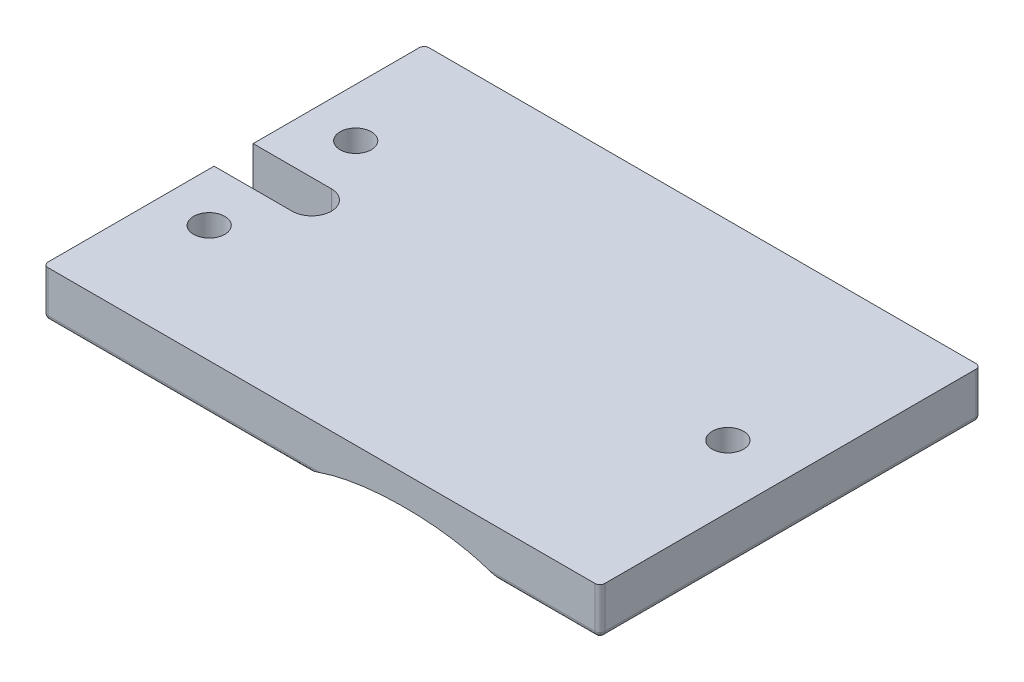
ISO-10303-21;
HEADER;
FILE_DESCRIPTION(('STEP AP214'),'2;1');
FILE_NAME('part.step','',(''),(''),'','','');
FILE_SCHEMA(('AUTOMOTIVE_DESIGN { 1 0 10303 214 1 1 1 1 }'));
ENDSEC;
DATA;
#1=APPLICATION_CONTEXT('core data for automotive mechanical design processes');
#2=APPLICATION_PROTOCOL_DEFINITION('international standard','automotive_design',2000,#1);
#3=PRODUCT_CONTEXT('',#1,'mechanical');
#4=PRODUCT('Part','Part','',(#3));
#5=PRODUCT_RELATED_PRODUCT_CATEGORY('part','',(#4));
#6=PRODUCT_DEFINITION_FORMATION('','',#4);
#7=PRODUCT_DEFINITION_CONTEXT('part definition',#1,'design');
#8=PRODUCT_DEFINITION('design','',#6,#7);
#9=PRODUCT_DEFINITION_SHAPE('','',#8);
#10=(LENGTH_UNIT() NAMED_UNIT(*) SI_UNIT(.MILLI.,.METRE.));
#11=(NAMED_UNIT(*) PLANE_ANGLE_UNIT() SI_UNIT($,.RADIAN.));
#12=(NAMED_UNIT(*) SI_UNIT($,.STERADIAN.) SOLID_ANGLE_UNIT());
#13=UNCERTAINTY_MEASURE_WITH_UNIT(LENGTH_MEASURE(1.E-05),#10,'distance_accuracy_value','');
#14=(GEOMETRIC_REPRESENTATION_CONTEXT(3) GLOBAL_UNCERTAINTY_ASSIGNED_CONTEXT((#13)) GLOBAL_UNIT_ASSIGNED_CONTEXT((#10,
#11,#12)) REPRESENTATION_CONTEXT('',''));
#15=CARTESIAN_POINT('',(0.,0.,0.));
#16=DIRECTION('',(0.,0.,1.));
#17=DIRECTION('',(1.,0.,0.));
#18=AXIS2_PLACEMENT_3D('',#15,#16,#17);
#19=CARTESIAN_POINT('',(-43.7316784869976,4.75,-5.7919621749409));
#20=DIRECTION('',(1.,0.,0.));
#21=DIRECTION('',(0.,0.,-1.));
#22=AXIS2_PLACEMENT_3D('',#19,#20,#21);
#23=PLANE('',#22);
#24=DIRECTION('',(0.,1.,0.));
#25=VECTOR('',#24,1.);
#26=CARTESIAN_POINT('',(-43.7316784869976,0.,15.7080378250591));
#27=LINE('',#26,#25);
#28=CARTESIAN_POINT('',(-43.7316784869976,0.5,15.7080378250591));
#29=VERTEX_POINT('',#28);
#30=CARTESIAN_POINT('',(-43.7316784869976,4.75,15.7080378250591));
#31=VERTEX_POINT('',#30);
#32=EDGE_CURVE('E209',#29,#31,#27,.T.);
#33=ORIENTED_EDGE('',*,*,#32,.F.);
#34=DIRECTION('',(0.,0.,1.));
#35=VECTOR('',#34,1.);
#36=CARTESIAN_POINT('',(-43.7316784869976,0.5,-5.7919621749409));
#37=LINE('',#36,#35);
#38=CARTESIAN_POINT('',(-43.7316784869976,0.5,32.7080378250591));
#39=VERTEX_POINT('',#38);
#40=EDGE_CURVE('E359',#29,#39,#37,.T.);
#41=ORIENTED_EDGE('',*,*,#40,.T.);
#42=DIRECTION('',(0.,-1.,0.));
#43=VECTOR('',#42,1.);
#44=CARTESIAN_POINT('',(-43.7316784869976,4.75,32.7080378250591));
#45=LINE('',#44,#43);
#46=CARTESIAN_POINT('',(-43.7316784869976,4.75,32.7080378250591));
#47=VERTEX_POINT('',#46);
#48=EDGE_CURVE('E358',#39,#47,#45,.F.);
#49=ORIENTED_EDGE('',*,*,#48,.T.);
#50=DIRECTION('',(0.,0.,1.));
#51=VECTOR('',#50,1.);
#52=CARTESIAN_POINT('',(-43.7316784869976,4.75,-5.7919621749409));
#53=LINE('',#52,#51);
#54=EDGE_CURVE('E245',#31,#47,#53,.T.);
#55=ORIENTED_EDGE('',*,*,#54,.F.);
#56=EDGE_LOOP('',(#33,#41,#49,#55));
#57=FACE_BOUND('',#56,.T.);
#58=ADVANCED_FACE('F35',(#57),#23,.F.);
#59=CARTESIAN_POINT('',(0.,4.75,0.));
#60=DIRECTION('',(0.,1.,0.));
#61=DIRECTION('',(0.,0.,1.));
#62=AXIS2_PLACEMENT_3D('',#59,#60,#61);
#63=PLANE('',#62);
#64=CARTESIAN_POINT('',(6.86832151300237,4.75,13.7080378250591));
#65=DIRECTION('',(0.,-1.,0.));
#66=DIRECTION('',(0.,0.,-1.));
#67=AXIS2_PLACEMENT_3D('',#64,#65,#66);
#68=CIRCLE('',#67,1.6);
#69=CARTESIAN_POINT('',(6.86832151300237,4.75,12.1080378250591));
#70=VERTEX_POINT('',#69);
#71=EDGE_CURVE('E219',#70,#70,#68,.T.);
#72=ORIENTED_EDGE('',*,*,#71,.T.);
#73=EDGE_LOOP('',(#72));
#74=FACE_BOUND('',#73,.T.);
#75=CARTESIAN_POINT('',(-38.7316784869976,4.75,21.2080378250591));
#76=DIRECTION('',(0.,-1.,0.));
#77=DIRECTION('',(0.,0.,-1.));
#78=AXIS2_PLACEMENT_3D('',#75,#76,#77);
#79=CIRCLE('',#78,1.6);
#80=CARTESIAN_POINT('',(-38.7316784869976,4.75,19.6080378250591));
#81=VERTEX_POINT('',#80);
#82=EDGE_CURVE('E228',#81,#81,#79,.T.);
#83=ORIENTED_EDGE('',*,*,#82,.T.);
#84=EDGE_LOOP('',(#83));
#85=FACE_BOUND('',#84,.T.);
#86=CARTESIAN_POINT('',(-38.7316784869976,4.75,6.2080378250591));
#87=DIRECTION('',(0.,-1.,0.));
#88=DIRECTION('',(0.,0.,-1.));
#89=AXIS2_PLACEMENT_3D('',#86,#87,#88);
#90=CIRCLE('',#89,1.6);
#91=CARTESIAN_POINT('',(-38.7316784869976,4.75,4.60803782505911));
#92=VERTEX_POINT('',#91);
#93=EDGE_CURVE('E237',#92,#92,#90,.T.);
#94=ORIENTED_EDGE('',*,*,#93,.T.);
#95=EDGE_LOOP('',(#94));
#96=FACE_BOUND('',#95,.T.);
#97=CARTESIAN_POINT('',(-35.7316784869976,4.75,13.7080378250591));
#98=DIRECTION('',(0.,1.,0.));
#99=DIRECTION('',(0.,0.,1.));
#100=AXIS2_PLACEMENT_3D('',#97,#98,#99);
#101=CIRCLE('',#100,2.);
#102=CARTESIAN_POINT('',(-35.7316784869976,4.75,15.7080378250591));
#103=VERTEX_POINT('',#102);
#104=CARTESIAN_POINT('',(-35.7316784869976,4.75,11.7080378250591));
#105=VERTEX_POINT('',#104);
#106=EDGE_CURVE('E203',#103,#105,#101,.T.);
#107=ORIENTED_EDGE('',*,*,#106,.F.);
#108=DIRECTION('',(-1.,0.,0.));
#109=VECTOR('',#108,1.);
#110=CARTESIAN_POINT('',(0.,4.75,15.7080378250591));
#111=LINE('',#110,#109);
#112=EDGE_CURVE('E184',#103,#31,#111,.T.);
#113=ORIENTED_EDGE('',*,*,#112,.T.);
#114=ORIENTED_EDGE('',*,*,#54,.T.);
#115=CARTESIAN_POINT('',(-43.2316784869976,4.75,32.7080378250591));
#116=DIRECTION('',(0.,1.,0.));
#117=DIRECTION('',(0.,0.,1.));
#118=AXIS2_PLACEMENT_3D('',#115,#116,#117);
#119=CIRCLE('',#118,0.5);
#120=CARTESIAN_POINT('',(-43.2316784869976,4.75,33.2080378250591));
#121=VERTEX_POINT('',#120);
#122=EDGE_CURVE('E419',#47,#121,#119,.T.);
#123=ORIENTED_EDGE('',*,*,#122,.T.);
#124=DIRECTION('',(1.,0.,0.));
#125=VECTOR('',#124,1.);
#126=CARTESIAN_POINT('',(-43.7316784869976,4.75,33.2080378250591));
#127=LINE('',#126,#125);
#128=CARTESIAN_POINT('',(12.7683215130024,4.75,33.2080378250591));
#129=VERTEX_POINT('',#128);
#130=EDGE_CURVE('E542',#121,#129,#127,.T.);
#131=ORIENTED_EDGE('',*,*,#130,.T.);
#132=CARTESIAN_POINT('',(12.7683215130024,4.75,32.7080378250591));
#133=DIRECTION('',(0.,1.,0.));
#134=DIRECTION('',(0.,0.,1.));
#135=AXIS2_PLACEMENT_3D('',#132,#133,#134);
#136=CIRCLE('',#135,0.5);
#137=CARTESIAN_POINT('',(13.2683215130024,4.75,32.7080378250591));
#138=VERTEX_POINT('',#137);
#139=EDGE_CURVE('E417',#129,#138,#136,.T.);
#140=ORIENTED_EDGE('',*,*,#139,.T.);
#141=DIRECTION('',(0.,0.,-1.));
#142=VECTOR('',#141,1.);
#143=CARTESIAN_POINT('',(13.2683215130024,4.75,-5.7919621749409));
#144=LINE('',#143,#142);
#145=CARTESIAN_POINT('',(13.2683215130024,4.75,-5.2919621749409));
#146=VERTEX_POINT('',#145);
#147=EDGE_CURVE('E404',#138,#146,#144,.T.);
#148=ORIENTED_EDGE('',*,*,#147,.T.);
#149=CARTESIAN_POINT('',(12.7683215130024,4.75,-5.2919621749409));
#150=DIRECTION('',(0.,1.,0.));
#151=DIRECTION('',(0.,0.,1.));
#152=AXIS2_PLACEMENT_3D('',#149,#150,#151);
#153=CIRCLE('',#152,0.5);
#154=CARTESIAN_POINT('',(12.7683215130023,4.75,-5.7919621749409));
#155=VERTEX_POINT('',#154);
#156=EDGE_CURVE('E363',#146,#155,#153,.T.);
#157=ORIENTED_EDGE('',*,*,#156,.T.);
#158=DIRECTION('',(-1.,0.,0.));
#159=VECTOR('',#158,1.);
#160=CARTESIAN_POINT('',(-43.7316784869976,4.75,-5.7919621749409));
#161=LINE('',#160,#159);
#162=CARTESIAN_POINT('',(-43.2316784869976,4.75,-5.7919621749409));
#163=VERTEX_POINT('',#162);
#164=EDGE_CURVE('E400',#155,#163,#161,.T.);
#165=ORIENTED_EDGE('',*,*,#164,.T.);
#166=CARTESIAN_POINT('',(-43.2316784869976,4.75,-5.2919621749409));
#167=DIRECTION('',(0.,1.,0.));
#168=DIRECTION('',(0.,0.,1.));
#169=AXIS2_PLACEMENT_3D('',#166,#167,#168);
#170=CIRCLE('',#169,0.5);
#171=CARTESIAN_POINT('',(-43.7316784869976,4.75,-5.2919621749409));
#172=VERTEX_POINT('',#171);
#173=EDGE_CURVE('E420',#163,#172,#170,.T.);
#174=ORIENTED_EDGE('',*,*,#173,.T.);
#175=CARTESIAN_POINT('',(-43.7316784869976,4.75,11.7080378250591));
#176=VERTEX_POINT('',#175);
#177=EDGE_CURVE('E541',#172,#176,#53,.T.);
#178=ORIENTED_EDGE('',*,*,#177,.T.);
#179=DIRECTION('',(-1.,0.,0.));
#180=VECTOR('',#179,1.);
#181=CARTESIAN_POINT('',(0.,4.75,11.7080378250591));
#182=LINE('',#181,#180);
#183=EDGE_CURVE('E201',#105,#176,#182,.T.);
#184=ORIENTED_EDGE('',*,*,#183,.F.);
#185=EDGE_LOOP('',(#107,#113,#114,#123,#131,#140,#148,#157,#165,#174,#178,#184));
#186=FACE_BOUND('',#185,.T.);
#187=ADVANCED_FACE('F259',(#74,#85,#96,#186),#63,.T.);
#188=CARTESIAN_POINT('',(0.,0.,0.));
#189=DIRECTION('',(0.,1.,0.));
#190=DIRECTION('',(0.,0.,1.));
#191=AXIS2_PLACEMENT_3D('',#188,#189,#190);
#192=PLANE('',#191);
#193=CARTESIAN_POINT('',(-38.7316784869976,0.,6.2080378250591));
#194=DIRECTION('',(0.,-1.,0.));
#195=DIRECTION('',(0.,0.,-1.));
#196=AXIS2_PLACEMENT_3D('',#193,#194,#195);
#197=CIRCLE('',#196,3.15);
#198=CARTESIAN_POINT('',(-38.7316784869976,0.,3.0580378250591));
#199=VERTEX_POINT('',#198);
#200=EDGE_CURVE('E231',#199,#199,#197,.T.);
#201=ORIENTED_EDGE('',*,*,#200,.F.);
#202=EDGE_LOOP('',(#201));
#203=FACE_BOUND('',#202,.T.);
#204=CARTESIAN_POINT('',(-38.7316784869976,0.,21.2080378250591));
#205=DIRECTION('',(0.,-1.,0.));
#206=DIRECTION('',(0.,0.,-1.));
#207=AXIS2_PLACEMENT_3D('',#204,#205,#206);
#208=CIRCLE('',#207,3.15);
#209=CARTESIAN_POINT('',(-38.7316784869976,0.,18.0580378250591));
#210=VERTEX_POINT('',#209);
#211=EDGE_CURVE('E222',#210,#210,#208,.T.);
#212=ORIENTED_EDGE('',*,*,#211,.F.);
#213=EDGE_LOOP('',(#212));
#214=FACE_BOUND('',#213,.T.);
#215=DIRECTION('',(-1.,0.,0.));
#216=VECTOR('',#215,1.);
#217=CARTESIAN_POINT('',(0.,0.,15.7080378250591));
#218=LINE('',#217,#216);
#219=CARTESIAN_POINT('',(-35.7316784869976,0.,15.7080378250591));
#220=VERTEX_POINT('',#219);
#221=CARTESIAN_POINT('',(-43.2316784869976,0.,15.7080378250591));
#222=VERTEX_POINT('',#221);
#223=EDGE_CURVE('E182',#220,#222,#218,.T.);
#224=ORIENTED_EDGE('',*,*,#223,.F.);
#225=CARTESIAN_POINT('',(-35.7316784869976,0.,13.7080378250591));
#226=DIRECTION('',(0.,1.,0.));
#227=DIRECTION('',(0.,0.,1.));
#228=AXIS2_PLACEMENT_3D('',#225,#226,#227);
#229=CIRCLE('',#228,2.);
#230=CARTESIAN_POINT('',(-35.7316784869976,0.,11.7080378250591));
#231=VERTEX_POINT('',#230);
#232=EDGE_CURVE('E192',#220,#231,#229,.T.);
#233=ORIENTED_EDGE('',*,*,#232,.T.);
#234=DIRECTION('',(-1.,0.,0.));
#235=VECTOR('',#234,1.);
#236=CARTESIAN_POINT('',(0.,0.,11.7080378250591));
#237=LINE('',#236,#235);
#238=CARTESIAN_POINT('',(-43.2316784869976,0.,11.7080378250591));
#239=VERTEX_POINT('',#238);
#240=EDGE_CURVE('E189',#231,#239,#237,.T.);
#241=ORIENTED_EDGE('',*,*,#240,.T.);
#242=DIRECTION('',(0.,0.,1.));
#243=VECTOR('',#242,1.);
#244=CARTESIAN_POINT('',(-43.2316784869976,0.,0.));
#245=LINE('',#244,#243);
#246=CARTESIAN_POINT('',(-43.2316784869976,0.,-5.2919621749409));
#247=VERTEX_POINT('',#246);
#248=EDGE_CURVE('E528',#239,#247,#245,.F.);
#249=ORIENTED_EDGE('',*,*,#248,.T.);
#250=DIRECTION('',(-1.,0.,0.));
#251=VECTOR('',#250,1.);
#252=CARTESIAN_POINT('',(0.,0.,-5.2919621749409));
#253=LINE('',#252,#251);
#254=CARTESIAN_POINT('',(-16.7355148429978,0.,-5.2919621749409));
#255=VERTEX_POINT('',#254);
#256=EDGE_CURVE('E58',#247,#255,#253,.F.);
#257=ORIENTED_EDGE('',*,*,#256,.T.);
#258=DIRECTION('',(0.,0.,-1.));
#259=VECTOR('',#258,1.);
#260=CARTESIAN_POINT('',(-16.7355148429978,0.,0.));
#261=LINE('',#260,#259);
#262=CARTESIAN_POINT('',(-16.7355148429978,0.,32.7080378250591));
#263=VERTEX_POINT('',#262);
#264=EDGE_CURVE('E503',#255,#263,#261,.F.);
#265=ORIENTED_EDGE('',*,*,#264,.T.);
#266=DIRECTION('',(1.,0.,0.));
#267=VECTOR('',#266,1.);
#268=CARTESIAN_POINT('',(0.,0.,32.7080378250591));
#269=LINE('',#268,#267);
#270=CARTESIAN_POINT('',(-43.2316784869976,0.,32.7080378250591));
#271=VERTEX_POINT('',#270);
#272=EDGE_CURVE('E525',#263,#271,#269,.F.);
#273=ORIENTED_EDGE('',*,*,#272,.T.);
#274=EDGE_CURVE('E200',#271,#222,#245,.F.);
#275=ORIENTED_EDGE('',*,*,#274,.T.);
#276=EDGE_LOOP('',(#224,#233,#241,#249,#257,#265,#273,#275));
#277=FACE_BOUND('',#276,.T.);
#278=ADVANCED_FACE('F198',(#203,#214,#277),#192,.F.);
#279=CARTESIAN_POINT('',(-43.2316784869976,0.5,-5.7919621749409));
#280=DIRECTION('',(0.,0.,1.));
#281=DIRECTION('',(1.,0.,0.));
#282=AXIS2_PLACEMENT_3D('',#279,#280,#281);
#283=CYLINDRICAL_SURFACE('',#282,0.5);
#284=ORIENTED_EDGE('',*,*,#40,.F.);
#285=CARTESIAN_POINT('',(-43.2316784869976,0.5,15.7080378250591));
#286=DIRECTION('',(0.,0.,-1.));
#287=DIRECTION('',(-1.,0.,0.));
#288=AXIS2_PLACEMENT_3D('',#285,#286,#287);
#289=CIRCLE('',#288,0.5);
#290=EDGE_CURVE('E11',#29,#222,#289,.F.);
#291=ORIENTED_EDGE('',*,*,#290,.T.);
#292=ORIENTED_EDGE('',*,*,#274,.F.);
#293=CARTESIAN_POINT('',(-43.2316784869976,0.5,32.7080378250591));
#294=DIRECTION('',(0.,0.,1.));
#295=DIRECTION('',(1.,0.,0.));
#296=AXIS2_PLACEMENT_3D('',#293,#294,#295);
#297=CIRCLE('',#296,0.5);
#298=EDGE_CURVE('E494',#271,#39,#297,.F.);
#299=ORIENTED_EDGE('',*,*,#298,.T.);
#300=EDGE_LOOP('',(#284,#291,#292,#299));
#301=FACE_BOUND('',#300,.T.);
#302=ADVANCED_FACE('F310',(#301),#283,.T.);
#303=CARTESIAN_POINT('',(6.86832151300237,0.,13.7080378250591));
#304=DIRECTION('',(0.,-1.,0.));
#305=DIRECTION('',(0.,0.,-1.));
#306=AXIS2_PLACEMENT_3D('',#303,#304,#305);
#307=CIRCLE('',#306,3.15);
#308=CARTESIAN_POINT('',(6.86832151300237,0.,10.5580378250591));
#309=VERTEX_POINT('',#308);
#310=EDGE_CURVE('E211',#309,#309,#307,.T.);
#311=ORIENTED_EDGE('',*,*,#310,.F.);
#312=EDGE_LOOP('',(#311));
#313=FACE_BOUND('',#312,.T.);
#314=DIRECTION('',(0.,0.,-1.));
#315=VECTOR('',#314,1.);
#316=CARTESIAN_POINT('',(3.27215786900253,0.,0.));
#317=LINE('',#316,#315);
#318=CARTESIAN_POINT('',(3.27215786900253,0.,32.7080378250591));
#319=VERTEX_POINT('',#318);
#320=CARTESIAN_POINT('',(3.27215786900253,0.,-5.2919621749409));
#321=VERTEX_POINT('',#320);
#322=EDGE_CURVE('E452',#319,#321,#317,.T.);
#323=ORIENTED_EDGE('',*,*,#322,.T.);
#324=DIRECTION('',(-1.,0.,0.));
#325=VECTOR('',#324,1.);
#326=CARTESIAN_POINT('',(0.,0.,-5.2919621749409));
#327=LINE('',#326,#325);
#328=CARTESIAN_POINT('',(12.7683215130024,0.,-5.2919621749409));
#329=VERTEX_POINT('',#328);
#330=EDGE_CURVE('E522',#321,#329,#327,.F.);
#331=ORIENTED_EDGE('',*,*,#330,.T.);
#332=DIRECTION('',(0.,0.,-1.));
#333=VECTOR('',#332,1.);
#334=CARTESIAN_POINT('',(12.7683215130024,0.,0.));
#335=LINE('',#334,#333);
#336=CARTESIAN_POINT('',(12.7683215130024,0.,32.7080378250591));
#337=VERTEX_POINT('',#336);
#338=EDGE_CURVE('E521',#329,#337,#335,.F.);
#339=ORIENTED_EDGE('',*,*,#338,.T.);
#340=DIRECTION('',(1.,0.,0.));
#341=VECTOR('',#340,1.);
#342=CARTESIAN_POINT('',(0.,0.,32.7080378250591));
#343=LINE('',#342,#341);
#344=EDGE_CURVE('E451',#337,#319,#343,.F.);
#345=ORIENTED_EDGE('',*,*,#344,.T.);
#346=EDGE_LOOP('',(#323,#331,#339,#345));
#347=FACE_BOUND('',#346,.T.);
#348=ADVANCED_FACE('F340',(#313,#347),#192,.F.);
#349=CARTESIAN_POINT('',(-43.7316784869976,0.5,-5.2919621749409));
#350=VERTEX_POINT('',#349);
#351=CARTESIAN_POINT('',(-43.7316784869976,0.5,11.7080378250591));
#352=VERTEX_POINT('',#351);
#353=EDGE_CURVE('E352',#350,#352,#37,.T.);
#354=ORIENTED_EDGE('',*,*,#353,.T.);
#355=DIRECTION('',(0.,1.,0.));
#356=VECTOR('',#355,1.);
#357=CARTESIAN_POINT('',(-43.7316784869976,0.,11.7080378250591));
#358=LINE('',#357,#356);
#359=EDGE_CURVE('E50',#352,#176,#358,.T.);
#360=ORIENTED_EDGE('',*,*,#359,.T.);
#361=ORIENTED_EDGE('',*,*,#177,.F.);
#362=DIRECTION('',(0.,-1.,0.));
#363=VECTOR('',#362,1.);
#364=CARTESIAN_POINT('',(-43.7316784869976,4.75,-5.2919621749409));
#365=LINE('',#364,#363);
#366=EDGE_CURVE('E356',#172,#350,#365,.T.);
#367=ORIENTED_EDGE('',*,*,#366,.T.);
#368=EDGE_LOOP('',(#354,#360,#361,#367));
#369=FACE_BOUND('',#368,.T.);
#370=ADVANCED_FACE('F330',(#369),#23,.F.);
#371=CARTESIAN_POINT('',(-43.7316784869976,4.75,33.2080378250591));
#372=DIRECTION('',(0.,0.,-1.));
#373=DIRECTION('',(-1.,0.,0.));
#374=AXIS2_PLACEMENT_3D('',#371,#372,#373);
#375=PLANE('',#374);
#376=DIRECTION('',(1.,0.,0.));
#377=VECTOR('',#376,1.);
#378=CARTESIAN_POINT('',(-43.7316784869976,0.5,33.2080378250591));
#379=LINE('',#378,#377);
#380=CARTESIAN_POINT('',(1.91408512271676,0.5,33.2080378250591));
#381=VERTEX_POINT('',#380);
#382=CARTESIAN_POINT('',(12.7683215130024,0.5,33.2080378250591));
#383=VERTEX_POINT('',#382);
#384=EDGE_CURVE('E372',#381,#383,#379,.T.);
#385=ORIENTED_EDGE('',*,*,#384,.T.);
#386=DIRECTION('',(0.,-1.,0.));
#387=VECTOR('',#386,1.);
#388=CARTESIAN_POINT('',(12.7683215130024,4.75,33.2080378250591));
#389=LINE('',#388,#387);
#390=EDGE_CURVE('E373',#383,#129,#389,.F.);
#391=ORIENTED_EDGE('',*,*,#390,.T.);
#392=ORIENTED_EDGE('',*,*,#130,.F.);
#393=DIRECTION('',(0.,-1.,0.));
#394=VECTOR('',#393,1.);
#395=CARTESIAN_POINT('',(-43.2316784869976,4.75,33.2080378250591));
#396=LINE('',#395,#394);
#397=CARTESIAN_POINT('',(-43.2316784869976,0.5,33.2080378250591));
#398=VERTEX_POINT('',#397);
#399=EDGE_CURVE('E370',#121,#398,#396,.T.);
#400=ORIENTED_EDGE('',*,*,#399,.T.);
#401=DIRECTION('',(1.,0.,0.));
#402=VECTOR('',#401,1.);
#403=CARTESIAN_POINT('',(-43.7316784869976,0.5,33.2080378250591));
#404=LINE('',#403,#402);
#405=CARTESIAN_POINT('',(-15.3774420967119,0.500000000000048,33.2080378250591));
#406=VERTEX_POINT('',#405);
#407=EDGE_CURVE('E368',#398,#406,#404,.T.);
#408=ORIENTED_EDGE('',*,*,#407,.T.);
#409=CARTESIAN_POINT('',(-6.73167848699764,-2.75,33.2080378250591));
#410=DIRECTION('',(0.,0.,-1.));
#411=DIRECTION('',(-1.,0.,0.));
#412=AXIS2_PLACEMENT_3D('',#409,#410,#411);
#413=ELLIPSE('',#412,12.5,4.5);
#414=EDGE_CURVE('E241',#406,#381,#413,.T.);
#415=ORIENTED_EDGE('',*,*,#414,.T.);
#416=EDGE_LOOP('',(#385,#391,#392,#400,#408,#415));
#417=FACE_BOUND('',#416,.T.);
#418=ADVANCED_FACE('F339',(#417),#375,.F.);
#419=CARTESIAN_POINT('',(13.2683215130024,4.75,-5.7919621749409));
#420=DIRECTION('',(-1.,0.,0.));
#421=DIRECTION('',(0.,0.,1.));
#422=AXIS2_PLACEMENT_3D('',#419,#420,#421);
#423=PLANE('',#422);
#424=DIRECTION('',(0.,0.,-1.));
#425=VECTOR('',#424,1.);
#426=CARTESIAN_POINT('',(13.2683215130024,0.5,-5.7919621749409));
#427=LINE('',#426,#425);
#428=CARTESIAN_POINT('',(13.2683215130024,0.5,32.7080378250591));
#429=VERTEX_POINT('',#428);
#430=CARTESIAN_POINT('',(13.2683215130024,0.5,-5.2919621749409));
#431=VERTEX_POINT('',#430);
#432=EDGE_CURVE('E411',#429,#431,#427,.T.);
#433=ORIENTED_EDGE('',*,*,#432,.T.);
#434=DIRECTION('',(0.,-1.,0.));
#435=VECTOR('',#434,1.);
#436=CARTESIAN_POINT('',(13.2683215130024,4.75,-5.2919621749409));
#437=LINE('',#436,#435);
#438=EDGE_CURVE('E415',#431,#146,#437,.F.);
#439=ORIENTED_EDGE('',*,*,#438,.T.);
#440=ORIENTED_EDGE('',*,*,#147,.F.);
#441=DIRECTION('',(0.,-1.,0.));
#442=VECTOR('',#441,1.);
#443=CARTESIAN_POINT('',(13.2683215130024,4.75,32.7080378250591));
#444=LINE('',#443,#442);
#445=EDGE_CURVE('E413',#138,#429,#444,.T.);
#446=ORIENTED_EDGE('',*,*,#445,.T.);
#447=EDGE_LOOP('',(#433,#439,#440,#446));
#448=FACE_BOUND('',#447,.T.);
#449=ADVANCED_FACE('F346',(#448),#423,.F.);
#450=CARTESIAN_POINT('',(-43.7316784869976,4.75,-5.7919621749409));
#451=DIRECTION('',(0.,0.,1.));
#452=DIRECTION('',(1.,0.,0.));
#453=AXIS2_PLACEMENT_3D('',#450,#451,#452);
#454=PLANE('',#453);
#455=ORIENTED_EDGE('',*,*,#164,.F.);
#456=DIRECTION('',(0.,-1.,0.));
#457=VECTOR('',#456,1.);
#458=CARTESIAN_POINT('',(12.7683215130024,4.75,-5.7919621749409));
#459=LINE('',#458,#457);
#460=CARTESIAN_POINT('',(12.7683215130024,0.5,-5.7919621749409));
#461=VERTEX_POINT('',#460);
#462=EDGE_CURVE('E409',#155,#461,#459,.T.);
#463=ORIENTED_EDGE('',*,*,#462,.T.);
#464=DIRECTION('',(-1.,0.,0.));
#465=VECTOR('',#464,1.);
#466=CARTESIAN_POINT('',(-43.7316784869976,0.5,-5.7919621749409));
#467=LINE('',#466,#465);
#468=CARTESIAN_POINT('',(1.91408512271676,0.5,-5.7919621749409));
#469=VERTEX_POINT('',#468);
#470=EDGE_CURVE('E394',#461,#469,#467,.T.);
#471=ORIENTED_EDGE('',*,*,#470,.T.);
#472=CARTESIAN_POINT('',(-6.73167848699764,-2.75,-5.7919621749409));
#473=DIRECTION('',(0.,0.,-1.));
#474=DIRECTION('',(-1.,0.,0.));
#475=AXIS2_PLACEMENT_3D('',#472,#473,#474);
#476=ELLIPSE('',#475,12.5,4.5);
#477=CARTESIAN_POINT('',(-15.377442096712,0.5,-5.7919621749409));
#478=VERTEX_POINT('',#477);
#479=EDGE_CURVE('E246',#478,#469,#476,.T.);
#480=ORIENTED_EDGE('',*,*,#479,.F.);
#481=DIRECTION('',(-1.,0.,0.));
#482=VECTOR('',#481,1.);
#483=CARTESIAN_POINT('',(-43.7316784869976,0.5,-5.7919621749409));
#484=LINE('',#483,#482);
#485=CARTESIAN_POINT('',(-43.2316784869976,0.5,-5.7919621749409));
#486=VERTEX_POINT('',#485);
#487=EDGE_CURVE('E390',#478,#486,#484,.T.);
#488=ORIENTED_EDGE('',*,*,#487,.T.);
#489=DIRECTION('',(0.,-1.,0.));
#490=VECTOR('',#489,1.);
#491=CARTESIAN_POINT('',(-43.2316784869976,4.75,-5.7919621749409));
#492=LINE('',#491,#490);
#493=EDGE_CURVE('E399',#486,#163,#492,.F.);
#494=ORIENTED_EDGE('',*,*,#493,.T.);
#495=EDGE_LOOP('',(#455,#463,#471,#480,#488,#494));
#496=FACE_BOUND('',#495,.T.);
#497=ADVANCED_FACE('F255',(#496),#454,.F.);
#498=DIRECTION('',(0.,0.,-1.));
#499=VECTOR('',#498,1.);
#500=SURFACE_OF_LINEAR_EXTRUSION('',#413,#499);
#501=ORIENTED_EDGE('',*,*,#479,.T.);
#502=CARTESIAN_POINT('',(1.91408512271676,0.5,-5.7919621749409));
#503=CARTESIAN_POINT('',(1.95479724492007,0.485963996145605,-5.79195618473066));
#504=CARTESIAN_POINT('',(1.99545458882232,0.47175647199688,-5.79137061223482));
#505=CARTESIAN_POINT('',(2.07707760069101,0.442839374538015,-5.78890016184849));
#506=CARTESIAN_POINT('',(2.11804143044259,0.428125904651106,-5.78700040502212));
#507=CARTESIAN_POINT('',(2.20002692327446,0.39826251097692,-5.7817381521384));
#508=CARTESIAN_POINT('',(2.24104716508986,0.383110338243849,-5.77836602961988));
#509=CARTESIAN_POINT('',(2.32289405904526,0.352444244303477,-5.76995897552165));
#510=CARTESIAN_POINT('',(2.36372003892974,0.336929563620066,-5.76492019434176));
#511=CARTESIAN_POINT('',(2.44260547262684,0.306517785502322,-5.75327989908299));
#512=CARTESIAN_POINT('',(2.48068723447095,0.29163754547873,-5.74678685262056));
#513=CARTESIAN_POINT('',(2.55628455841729,0.261694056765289,-5.73183707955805));
#514=CARTESIAN_POINT('',(2.59380129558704,0.246631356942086,-5.72338528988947));
#515=CARTESIAN_POINT('',(2.6680570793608,0.216410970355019,-5.70414824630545));
#516=CARTESIAN_POINT('',(2.70479816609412,0.201253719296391,-5.69337026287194));
#517=CARTESIAN_POINT('',(2.77728285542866,0.170945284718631,-5.66892797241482));
#518=CARTESIAN_POINT('',(2.81302773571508,0.155794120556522,-5.65526757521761));
#519=CARTESIAN_POINT('',(2.86102136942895,0.135182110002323,-5.63397352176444));
#520=CARTESIAN_POINT('',(2.87393574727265,0.129607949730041,-5.62793873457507));
#521=CARTESIAN_POINT('',(2.89950155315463,0.118519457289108,-5.61529404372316));
#522=CARTESIAN_POINT('',(2.91215307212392,0.11300510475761,-5.60868434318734));
#523=CARTESIAN_POINT('',(2.93712563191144,0.102068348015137,-5.59482883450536));
#524=CARTESIAN_POINT('',(2.94944700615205,0.0966458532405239,-5.5875837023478));
#525=CARTESIAN_POINT('',(2.97387968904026,0.0858432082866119,-5.57225373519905));
#526=CARTESIAN_POINT('',(2.985984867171,0.0804649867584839,-5.56415771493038));
#527=CARTESIAN_POINT('',(3.00969115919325,0.0698842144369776,-5.54711236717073));
#528=CARTESIAN_POINT('',(3.02129168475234,0.0646818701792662,-5.53816208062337));
#529=CARTESIAN_POINT('',(3.04385766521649,0.0545184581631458,-5.51925136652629));
#530=CARTESIAN_POINT('',(3.05481967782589,0.0495587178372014,-5.50928614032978));
#531=CARTESIAN_POINT('',(3.06534530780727,0.0447763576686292,-5.49877473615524));
#532=B_SPLINE_CURVE_WITH_KNOTS('',3,(#502,#503,#504,#505,#506,#507,#508,#509,#510,#511,#512,
#513,#514,#515,#516,#517,#518,#519,#520,#521,#522,#523,#524,#525,#526,#527,#528,#529,#530,#531),
.UNSPECIFIED.,.F.,.F.,(4,2,2,2,2,2,2,2,2,2,2,2,2,2,4),(0.,0.129193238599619,0.259873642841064,
0.391421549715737,0.523275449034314,0.647427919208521,0.771270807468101,0.894732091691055,
1.01802697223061,1.06393455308,1.10982597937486,1.15566916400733,1.20221626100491,
1.24881624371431,1.29564779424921),.UNSPECIFIED.);
#533=CARTESIAN_POINT('',(3.06534530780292,0.0447763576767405,-5.49877473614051));
#534=VERTEX_POINT('',#533);
#535=EDGE_CURVE('E447',#469,#534,#532,.T.);
#536=ORIENTED_EDGE('',*,*,#535,.T.);
#537=DIRECTION('',(0.,0.,-1.));
#538=VECTOR('',#537,1.);
#539=CARTESIAN_POINT('',(3.06534530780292,0.0447763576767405,-5.7919621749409));
#540=LINE('',#539,#538);
#541=CARTESIAN_POINT('',(3.06534530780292,0.0447763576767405,32.9148503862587));
#542=VERTEX_POINT('',#541);
#543=EDGE_CURVE('E285',#534,#542,#540,.F.);
#544=ORIENTED_EDGE('',*,*,#543,.T.);
#545=CARTESIAN_POINT('',(3.06534530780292,0.0447763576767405,32.9148503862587));
#546=CARTESIAN_POINT('',(3.05082439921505,0.0513748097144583,32.9293241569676));
#547=CARTESIAN_POINT('',(3.03550912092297,0.0582933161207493,32.9427692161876));
#548=CARTESIAN_POINT('',(3.00373704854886,0.0725540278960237,32.967850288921));
#549=CARTESIAN_POINT('',(2.98728469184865,0.0798945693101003,32.9794928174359));
#550=CARTESIAN_POINT('',(2.95378194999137,0.0947417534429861,33.0011843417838));
#551=CARTESIAN_POINT('',(2.93674154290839,0.102245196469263,33.0112513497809));
#552=CARTESIAN_POINT('',(2.90205169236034,0.11741728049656,33.0301828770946));
#553=CARTESIAN_POINT('',(2.88440155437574,0.125086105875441,33.0390459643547));
#554=CARTESIAN_POINT('',(2.82184985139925,0.152076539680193,33.0682631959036));
#555=CARTESIAN_POINT('',(2.77578181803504,0.171623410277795,33.085913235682));
#556=CARTESIAN_POINT('',(2.68212185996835,0.210669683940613,33.1165708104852));
#557=CARTESIAN_POINT('',(2.63452810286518,0.230168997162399,33.1295725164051));
#558=CARTESIAN_POINT('',(2.53768682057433,0.269157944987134,33.1521396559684));
#559=CARTESIAN_POINT('',(2.48842526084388,0.288643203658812,33.1616516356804));
#560=CARTESIAN_POINT('',(2.38924854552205,0.327189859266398,33.1776876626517));
#561=CARTESIAN_POINT('',(2.3393331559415,0.346251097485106,33.1842106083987));
#562=CARTESIAN_POINT('',(2.22654921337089,0.388579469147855,33.1960798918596));
#563=CARTESIAN_POINT('',(2.16355701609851,0.41170899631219,33.2007262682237));
#564=CARTESIAN_POINT('',(2.03843426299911,0.456684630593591,33.2066517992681));
#565=CARTESIAN_POINT('',(1.9763130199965,0.478547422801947,33.2079989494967));
#566=CARTESIAN_POINT('',(1.91408512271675,0.500000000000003,33.2080378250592));
#567=B_SPLINE_CURVE_WITH_KNOTS('',3,(#545,#546,#547,#548,#549,#550,#551,#552,#553,#554,#555,
#556,#557,#558,#559,#560,#561,#562,#563,#564,#565,#566),.UNSPECIFIED.,.F.,.F.,(4,2,2,2,2,2,2,2,
2,2,4),(0.,0.0644896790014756,0.12874053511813,0.192192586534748,0.255719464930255,
0.414531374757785,0.573541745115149,0.734895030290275,0.896307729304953,1.09800537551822,
1.29550977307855),.UNSPECIFIED.);
#568=EDGE_CURVE('E279',#542,#381,#567,.T.);
#569=ORIENTED_EDGE('',*,*,#568,.T.);
#570=ORIENTED_EDGE('',*,*,#414,.F.);
#571=CARTESIAN_POINT('',(-15.3774420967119,0.500000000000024,33.2080378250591));
#572=CARTESIAN_POINT('',(-15.4181542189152,0.485963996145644,33.2080318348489));
#573=CARTESIAN_POINT('',(-15.4588115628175,0.471756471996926,33.207446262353));
#574=CARTESIAN_POINT('',(-15.5404345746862,0.442839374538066,33.2049758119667));
#575=CARTESIAN_POINT('',(-15.5813984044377,0.428125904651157,33.2030760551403));
#576=CARTESIAN_POINT('',(-15.6633838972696,0.398262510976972,33.1978138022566));
#577=CARTESIAN_POINT('',(-15.704404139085,0.383110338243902,33.1944416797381));
#578=CARTESIAN_POINT('',(-15.7862510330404,0.352444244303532,33.1860346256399));
#579=CARTESIAN_POINT('',(-15.8270770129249,0.33692956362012,33.18099584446));
#580=CARTESIAN_POINT('',(-15.905962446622,0.306517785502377,33.1693555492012));
#581=CARTESIAN_POINT('',(-15.9440442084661,0.291637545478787,33.1628625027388));
#582=CARTESIAN_POINT('',(-16.0196415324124,0.261694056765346,33.1479127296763));
#583=CARTESIAN_POINT('',(-16.0571582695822,0.246631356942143,33.1394609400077));
#584=CARTESIAN_POINT('',(-16.1314140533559,0.216410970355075,33.1202238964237));
#585=CARTESIAN_POINT('',(-16.1681551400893,0.201253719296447,33.1094459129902));
#586=CARTESIAN_POINT('',(-16.2406398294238,0.17094528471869,33.0850036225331));
#587=CARTESIAN_POINT('',(-16.2763847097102,0.155794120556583,33.0713432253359));
#588=CARTESIAN_POINT('',(-16.3243783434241,0.135182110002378,33.0500491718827));
#589=CARTESIAN_POINT('',(-16.3372927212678,0.129607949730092,33.0440143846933));
#590=CARTESIAN_POINT('',(-16.3628585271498,0.118519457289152,33.0313696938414));
#591=CARTESIAN_POINT('',(-16.3755100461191,0.113005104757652,33.0247599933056));
#592=CARTESIAN_POINT('',(-16.4004826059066,0.102068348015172,33.0109044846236));
#593=CARTESIAN_POINT('',(-16.4128039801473,0.0966458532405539,33.003659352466));
#594=CARTESIAN_POINT('',(-16.4372366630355,0.0858432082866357,32.9883293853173));
#595=CARTESIAN_POINT('',(-16.4493418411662,0.0804649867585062,32.9802333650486));
#596=CARTESIAN_POINT('',(-16.4730481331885,0.0698842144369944,32.963188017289));
#597=CARTESIAN_POINT('',(-16.4846486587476,0.064681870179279,32.9542377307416));
#598=CARTESIAN_POINT('',(-16.5072146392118,0.0545184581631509,32.9353270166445));
#599=CARTESIAN_POINT('',(-16.5181766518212,0.049558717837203,32.925361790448));
#600=CARTESIAN_POINT('',(-16.5287022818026,0.04477635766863,32.9148503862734));
#601=B_SPLINE_CURVE_WITH_KNOTS('',3,(#571,#572,#573,#574,#575,#576,#577,#578,#579,#580,#581,
#582,#583,#584,#585,#586,#587,#588,#589,#590,#591,#592,#593,#594,#595,#596,#597,#598,#599,#600),
.UNSPECIFIED.,.F.,.F.,(4,2,2,2,2,2,2,2,2,2,2,2,2,2,4),(0.,0.129193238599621,0.259873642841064,
0.391421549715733,0.523275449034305,0.647427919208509,0.771270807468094,0.894732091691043,
1.0180269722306,1.06393455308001,1.1098259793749,1.1556691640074,1.202216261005,
1.24881624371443,1.29564779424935),.UNSPECIFIED.);
#602=CARTESIAN_POINT('',(-16.5287022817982,0.0447763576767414,32.9148503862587));
#603=VERTEX_POINT('',#602);
#604=EDGE_CURVE('E264',#406,#603,#601,.T.);
#605=ORIENTED_EDGE('',*,*,#604,.T.);
#606=DIRECTION('',(0.,0.,-1.));
#607=VECTOR('',#606,1.);
#608=CARTESIAN_POINT('',(-16.5287022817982,0.0447763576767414,33.2080378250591));
#609=LINE('',#608,#607);
#610=CARTESIAN_POINT('',(-16.5287022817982,0.0447763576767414,-5.49877473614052));
#611=VERTEX_POINT('',#610);
#612=EDGE_CURVE('E377',#603,#611,#609,.T.);
#613=ORIENTED_EDGE('',*,*,#612,.T.);
#614=CARTESIAN_POINT('',(-16.5287022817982,0.0447763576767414,-5.49877473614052));
#615=CARTESIAN_POINT('',(-16.5141813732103,0.0513748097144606,-5.51324850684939));
#616=CARTESIAN_POINT('',(-16.4988660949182,0.0582933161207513,-5.52669356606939));
#617=CARTESIAN_POINT('',(-16.4670940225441,0.0725540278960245,-5.55177463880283));
#618=CARTESIAN_POINT('',(-16.4506416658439,0.0798945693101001,-5.56341716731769));
#619=CARTESIAN_POINT('',(-16.4171389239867,0.0947417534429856,-5.58510869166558));
#620=CARTESIAN_POINT('',(-16.4000985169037,0.102245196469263,-5.59517569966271));
#621=CARTESIAN_POINT('',(-16.3654086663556,0.11741728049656,-5.61410722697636));
#622=CARTESIAN_POINT('',(-16.347758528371,0.125086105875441,-5.62297031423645));
#623=CARTESIAN_POINT('',(-16.2852068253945,0.152076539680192,-5.6521875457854));
#624=CARTESIAN_POINT('',(-16.2391387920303,0.171623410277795,-5.66983758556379));
#625=CARTESIAN_POINT('',(-16.1454788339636,0.210669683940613,-5.70049516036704));
#626=CARTESIAN_POINT('',(-16.0978850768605,0.230168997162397,-5.71349686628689));
#627=CARTESIAN_POINT('',(-16.0010437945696,0.269157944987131,-5.73606400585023));
#628=CARTESIAN_POINT('',(-15.9517822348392,0.288643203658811,-5.74557598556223));
#629=CARTESIAN_POINT('',(-15.8526055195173,0.327189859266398,-5.76161201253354));
#630=CARTESIAN_POINT('',(-15.8026901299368,0.346251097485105,-5.76813495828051));
#631=CARTESIAN_POINT('',(-15.6899061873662,0.388579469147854,-5.78000424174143));
#632=CARTESIAN_POINT('',(-15.6269139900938,0.41170899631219,-5.78465061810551));
#633=CARTESIAN_POINT('',(-15.5017912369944,0.456684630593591,-5.79057614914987));
#634=CARTESIAN_POINT('',(-15.4396699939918,0.478547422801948,-5.7919232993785));
#635=CARTESIAN_POINT('',(-15.377442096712,0.500000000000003,-5.79196217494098));
#636=B_SPLINE_CURVE_WITH_KNOTS('',3,(#614,#615,#616,#617,#618,#619,#620,#621,#622,#623,#624,
#625,#626,#627,#628,#629,#630,#631,#632,#633,#634,#635),.UNSPECIFIED.,.F.,.F.,(4,2,2,2,2,2,2,2,
2,2,4),(0.,0.0644896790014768,0.128740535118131,0.19219258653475,0.255719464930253,
0.414531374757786,0.573541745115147,0.73489503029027,0.89630772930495,1.09800537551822,
1.29550977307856),.UNSPECIFIED.);
#637=EDGE_CURVE('E273',#611,#478,#636,.T.);
#638=ORIENTED_EDGE('',*,*,#637,.T.);
#639=EDGE_LOOP('',(#501,#536,#544,#569,#570,#605,#613,#638));
#640=FACE_BOUND('',#639,.T.);
#641=ADVANCED_FACE('F249',(#640),#500,.F.);
#642=CARTESIAN_POINT('',(-43.7316784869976,0.5,32.7080378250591));
#643=DIRECTION('',(1.,0.,0.));
#644=DIRECTION('',(0.,0.,-1.));
#645=AXIS2_PLACEMENT_3D('',#642,#643,#644);
#646=CYLINDRICAL_SURFACE('',#645,0.5);
#647=ORIENTED_EDGE('',*,*,#384,.F.);
#648=ORIENTED_EDGE('',*,*,#568,.F.);
#649=CARTESIAN_POINT('',(3.27215786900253,0.5,32.7080378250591));
#650=DIRECTION('',(0.707106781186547,0.,0.707106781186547));
#651=DIRECTION('',(0.707106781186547,0.,-0.707106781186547));
#652=AXIS2_PLACEMENT_3D('',#649,#650,#651);
#653=ELLIPSE('',#652,0.707106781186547,0.5);
#654=EDGE_CURVE('E395',#319,#542,#653,.F.);
#655=ORIENTED_EDGE('',*,*,#654,.F.);
#656=ORIENTED_EDGE('',*,*,#344,.F.);
#657=CARTESIAN_POINT('',(12.7683215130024,0.5,32.7080378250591));
#658=DIRECTION('',(1.,0.,0.));
#659=DIRECTION('',(0.,0.,-1.));
#660=AXIS2_PLACEMENT_3D('',#657,#658,#659);
#661=CIRCLE('',#660,0.5);
#662=EDGE_CURVE('E480',#383,#337,#661,.T.);
#663=ORIENTED_EDGE('',*,*,#662,.F.);
#664=EDGE_LOOP('',(#647,#648,#655,#656,#663));
#665=FACE_BOUND('',#664,.T.);
#666=ADVANCED_FACE('F254',(#665),#646,.T.);
#667=CARTESIAN_POINT('',(12.7683215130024,4.75,32.7080378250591));
#668=DIRECTION('',(0.,-1.,0.));
#669=DIRECTION('',(0.,0.,-1.));
#670=AXIS2_PLACEMENT_3D('',#667,#668,#669);
#671=CYLINDRICAL_SURFACE('',#670,0.5);
#672=ORIENTED_EDGE('',*,*,#139,.F.);
#673=ORIENTED_EDGE('',*,*,#390,.F.);
#674=CARTESIAN_POINT('',(12.7683215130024,0.5,32.7080378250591));
#675=DIRECTION('',(0.,-1.,0.));
#676=DIRECTION('',(0.,0.,-1.));
#677=AXIS2_PLACEMENT_3D('',#674,#675,#676);
#678=CIRCLE('',#677,0.5);
#679=EDGE_CURVE('E483',#429,#383,#678,.T.);
#680=ORIENTED_EDGE('',*,*,#679,.F.);
#681=ORIENTED_EDGE('',*,*,#445,.F.);
#682=EDGE_LOOP('',(#672,#673,#680,#681));
#683=FACE_BOUND('',#682,.T.);
#684=ADVANCED_FACE('F290',(#683),#671,.T.);
#685=CARTESIAN_POINT('',(3.27215786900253,0.500000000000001,13.7080378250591));
#686=DIRECTION('',(0.,0.,-1.));
#687=DIRECTION('',(-1.,0.,0.));
#688=AXIS2_PLACEMENT_3D('',#685,#686,#687);
#689=CYLINDRICAL_SURFACE('',#688,0.5);
#690=ORIENTED_EDGE('',*,*,#654,.T.);
#691=ORIENTED_EDGE('',*,*,#543,.F.);
#692=CARTESIAN_POINT('',(3.27215786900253,0.5,-5.2919621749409));
#693=DIRECTION('',(0.707106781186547,0.,-0.707106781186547));
#694=DIRECTION('',(-0.707106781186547,0.,-0.707106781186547));
#695=AXIS2_PLACEMENT_3D('',#692,#693,#694);
#696=ELLIPSE('',#695,0.707106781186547,0.5);
#697=EDGE_CURVE('E449',#321,#534,#696,.T.);
#698=ORIENTED_EDGE('',*,*,#697,.F.);
#699=ORIENTED_EDGE('',*,*,#322,.F.);
#700=EDGE_LOOP('',(#690,#691,#698,#699));
#701=FACE_BOUND('',#700,.T.);
#702=ADVANCED_FACE('F467',(#701),#689,.T.);
#703=CARTESIAN_POINT('',(12.7683215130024,0.5,32.7080378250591));
#704=DIRECTION('',(0.,0.,1.));
#705=DIRECTION('',(1.,0.,0.));
#706=AXIS2_PLACEMENT_3D('',#703,#704,#705);
#707=SPHERICAL_SURFACE('',#706,0.5);
#708=ORIENTED_EDGE('',*,*,#679,.T.);
#709=ORIENTED_EDGE('',*,*,#662,.T.);
#710=CARTESIAN_POINT('',(12.7683215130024,0.5,32.7080378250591));
#711=DIRECTION('',(0.,0.,1.));
#712=DIRECTION('',(1.,0.,0.));
#713=AXIS2_PLACEMENT_3D('',#710,#711,#712);
#714=CIRCLE('',#713,0.5);
#715=EDGE_CURVE('E443',#429,#337,#714,.F.);
#716=ORIENTED_EDGE('',*,*,#715,.F.);
#717=EDGE_LOOP('',(#708,#709,#716));
#718=FACE_BOUND('',#717,.T.);
#719=ADVANCED_FACE('F464',(#718),#707,.T.);
#720=CARTESIAN_POINT('',(-43.7316784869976,0.5,-5.2919621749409));
#721=DIRECTION('',(-1.,0.,0.));
#722=DIRECTION('',(0.,0.,1.));
#723=AXIS2_PLACEMENT_3D('',#720,#721,#722);
#724=CYLINDRICAL_SURFACE('',#723,0.5);
#725=ORIENTED_EDGE('',*,*,#535,.F.);
#726=ORIENTED_EDGE('',*,*,#470,.F.);
#727=CARTESIAN_POINT('',(12.7683215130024,0.5,-5.2919621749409));
#728=DIRECTION('',(1.,0.,0.));
#729=DIRECTION('',(0.,0.,-1.));
#730=AXIS2_PLACEMENT_3D('',#727,#728,#729);
#731=CIRCLE('',#730,0.5);
#732=EDGE_CURVE('E437',#329,#461,#731,.T.);
#733=ORIENTED_EDGE('',*,*,#732,.F.);
#734=ORIENTED_EDGE('',*,*,#330,.F.);
#735=ORIENTED_EDGE('',*,*,#697,.T.);
#736=EDGE_LOOP('',(#725,#726,#733,#734,#735));
#737=FACE_BOUND('',#736,.T.);
#738=ADVANCED_FACE('F445',(#737),#724,.T.);
#739=CARTESIAN_POINT('',(12.7683215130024,0.5,-5.7919621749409));
#740=DIRECTION('',(0.,0.,-1.));
#741=DIRECTION('',(-1.,0.,0.));
#742=AXIS2_PLACEMENT_3D('',#739,#740,#741);
#743=CYLINDRICAL_SURFACE('',#742,0.5);
#744=ORIENTED_EDGE('',*,*,#715,.T.);
#745=ORIENTED_EDGE('',*,*,#338,.F.);
#746=CARTESIAN_POINT('',(12.7683215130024,0.5,-5.2919621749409));
#747=DIRECTION('',(0.,0.,-1.));
#748=DIRECTION('',(-1.,0.,0.));
#749=AXIS2_PLACEMENT_3D('',#746,#747,#748);
#750=CIRCLE('',#749,0.5);
#751=EDGE_CURVE('E433',#431,#329,#750,.T.);
#752=ORIENTED_EDGE('',*,*,#751,.F.);
#753=ORIENTED_EDGE('',*,*,#432,.F.);
#754=EDGE_LOOP('',(#744,#745,#752,#753));
#755=FACE_BOUND('',#754,.T.);
#756=ADVANCED_FACE('F463',(#755),#743,.T.);
#757=CARTESIAN_POINT('',(12.7683215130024,0.5,-5.2919621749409));
#758=DIRECTION('',(0.,0.,1.));
#759=DIRECTION('',(1.,0.,0.));
#760=AXIS2_PLACEMENT_3D('',#757,#758,#759);
#761=SPHERICAL_SURFACE('',#760,0.5);
#762=ORIENTED_EDGE('',*,*,#751,.T.);
#763=ORIENTED_EDGE('',*,*,#732,.T.);
#764=CARTESIAN_POINT('',(12.7683215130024,0.5,-5.2919621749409));
#765=DIRECTION('',(0.,-1.,0.));
#766=DIRECTION('',(0.,0.,-1.));
#767=AXIS2_PLACEMENT_3D('',#764,#765,#766);
#768=CIRCLE('',#767,0.5);
#769=EDGE_CURVE('E430',#431,#461,#768,.F.);
#770=ORIENTED_EDGE('',*,*,#769,.F.);
#771=EDGE_LOOP('',(#762,#763,#770));
#772=FACE_BOUND('',#771,.T.);
#773=ADVANCED_FACE('F438',(#772),#761,.T.);
#774=CARTESIAN_POINT('',(12.7683215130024,4.75,-5.2919621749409));
#775=DIRECTION('',(0.,-1.,0.));
#776=DIRECTION('',(0.,0.,-1.));
#777=AXIS2_PLACEMENT_3D('',#774,#775,#776);
#778=CYLINDRICAL_SURFACE('',#777,0.5);
#779=ORIENTED_EDGE('',*,*,#156,.F.);
#780=ORIENTED_EDGE('',*,*,#438,.F.);
#781=ORIENTED_EDGE('',*,*,#769,.T.);
#782=ORIENTED_EDGE('',*,*,#462,.F.);
#783=EDGE_LOOP('',(#779,#780,#781,#782));
#784=FACE_BOUND('',#783,.T.);
#785=ADVANCED_FACE('F324',(#784),#778,.T.);
#786=CARTESIAN_POINT('',(-43.2316784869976,4.75,32.7080378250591));
#787=DIRECTION('',(0.,-1.,0.));
#788=DIRECTION('',(0.,0.,-1.));
#789=AXIS2_PLACEMENT_3D('',#786,#787,#788);
#790=CYLINDRICAL_SURFACE('',#789,0.5);
#791=ORIENTED_EDGE('',*,*,#122,.F.);
#792=ORIENTED_EDGE('',*,*,#48,.F.);
#793=CARTESIAN_POINT('',(-43.2316784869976,0.5,32.7080378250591));
#794=DIRECTION('',(0.,-1.,0.));
#795=DIRECTION('',(0.,0.,-1.));
#796=AXIS2_PLACEMENT_3D('',#793,#794,#795);
#797=CIRCLE('',#796,0.5);
#798=EDGE_CURVE('E434',#398,#39,#797,.T.);
#799=ORIENTED_EDGE('',*,*,#798,.F.);
#800=ORIENTED_EDGE('',*,*,#399,.F.);
#801=EDGE_LOOP('',(#791,#792,#799,#800));
#802=FACE_BOUND('',#801,.T.);
#803=ADVANCED_FACE('F37',(#802),#790,.T.);
#804=CARTESIAN_POINT('',(-43.7316784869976,0.5,32.7080378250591));
#805=DIRECTION('',(1.,0.,0.));
#806=DIRECTION('',(0.,0.,-1.));
#807=AXIS2_PLACEMENT_3D('',#804,#805,#806);
#808=CYLINDRICAL_SURFACE('',#807,0.5);
#809=ORIENTED_EDGE('',*,*,#604,.F.);
#810=ORIENTED_EDGE('',*,*,#407,.F.);
#811=CARTESIAN_POINT('',(-43.2316784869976,0.5,32.7080378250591));
#812=DIRECTION('',(-1.,0.,0.));
#813=DIRECTION('',(0.,0.,1.));
#814=AXIS2_PLACEMENT_3D('',#811,#812,#813);
#815=CIRCLE('',#814,0.5);
#816=EDGE_CURVE('E499',#271,#398,#815,.T.);
#817=ORIENTED_EDGE('',*,*,#816,.F.);
#818=ORIENTED_EDGE('',*,*,#272,.F.);
#819=CARTESIAN_POINT('',(-16.7355148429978,0.5,32.7080378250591));
#820=DIRECTION('',(0.707106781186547,0.,-0.707106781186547));
#821=DIRECTION('',(0.707106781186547,0.,0.707106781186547));
#822=AXIS2_PLACEMENT_3D('',#819,#820,#821);
#823=ELLIPSE('',#822,0.707106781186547,0.5);
#824=EDGE_CURVE('E497',#603,#263,#823,.T.);
#825=ORIENTED_EDGE('',*,*,#824,.F.);
#826=EDGE_LOOP('',(#809,#810,#817,#818,#825));
#827=FACE_BOUND('',#826,.T.);
#828=ADVANCED_FACE('F316',(#827),#808,.T.);
#829=CARTESIAN_POINT('',(-43.2316784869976,0.5,32.7080378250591));
#830=DIRECTION('',(0.,0.,1.));
#831=DIRECTION('',(1.,0.,0.));
#832=AXIS2_PLACEMENT_3D('',#829,#830,#831);
#833=SPHERICAL_SURFACE('',#832,0.5);
#834=ORIENTED_EDGE('',*,*,#816,.T.);
#835=ORIENTED_EDGE('',*,*,#798,.T.);
#836=ORIENTED_EDGE('',*,*,#298,.F.);
#837=EDGE_LOOP('',(#834,#835,#836));
#838=FACE_BOUND('',#837,.T.);
#839=ADVANCED_FACE('F313',(#838),#833,.T.);
#840=CARTESIAN_POINT('',(-16.7355148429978,0.500000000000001,13.7080378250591));
#841=DIRECTION('',(0.,0.,-1.));
#842=DIRECTION('',(-1.,0.,0.));
#843=AXIS2_PLACEMENT_3D('',#840,#841,#842);
#844=CYLINDRICAL_SURFACE('',#843,0.5);
#845=ORIENTED_EDGE('',*,*,#824,.T.);
#846=ORIENTED_EDGE('',*,*,#264,.F.);
#847=CARTESIAN_POINT('',(-16.7355148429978,0.5,-5.2919621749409));
#848=DIRECTION('',(-0.707106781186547,0.,-0.707106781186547));
#849=DIRECTION('',(-0.707106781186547,0.,0.707106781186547));
#850=AXIS2_PLACEMENT_3D('',#847,#848,#849);
#851=ELLIPSE('',#850,0.707106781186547,0.5);
#852=EDGE_CURVE('E492',#611,#255,#851,.T.);
#853=ORIENTED_EDGE('',*,*,#852,.F.);
#854=ORIENTED_EDGE('',*,*,#612,.F.);
#855=EDGE_LOOP('',(#845,#846,#853,#854));
#856=FACE_BOUND('',#855,.T.);
#857=ADVANCED_FACE('F308',(#856),#844,.T.);
#858=CARTESIAN_POINT('',(-43.2316784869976,0.5,11.7080378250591));
#859=DIRECTION('',(0.,0.,-1.));
#860=DIRECTION('',(-1.,0.,0.));
#861=AXIS2_PLACEMENT_3D('',#858,#859,#860);
#862=CIRCLE('',#861,0.5);
#863=EDGE_CURVE('E43',#352,#239,#862,.F.);
#864=ORIENTED_EDGE('',*,*,#863,.F.);
#865=ORIENTED_EDGE('',*,*,#353,.F.);
#866=CARTESIAN_POINT('',(-43.2316784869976,0.5,-5.2919621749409));
#867=DIRECTION('',(0.,0.,-1.));
#868=DIRECTION('',(-1.,0.,0.));
#869=AXIS2_PLACEMENT_3D('',#866,#867,#868);
#870=CIRCLE('',#869,0.5);
#871=EDGE_CURVE('E489',#247,#350,#870,.T.);
#872=ORIENTED_EDGE('',*,*,#871,.F.);
#873=ORIENTED_EDGE('',*,*,#248,.F.);
#874=EDGE_LOOP('',(#864,#865,#872,#873));
#875=FACE_BOUND('',#874,.T.);
#876=ADVANCED_FACE('F304',(#875),#283,.T.);
#877=CARTESIAN_POINT('',(-43.7316784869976,0.5,-5.2919621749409));
#878=DIRECTION('',(-1.,0.,0.));
#879=DIRECTION('',(0.,0.,1.));
#880=AXIS2_PLACEMENT_3D('',#877,#878,#879);
#881=CYLINDRICAL_SURFACE('',#880,0.5);
#882=ORIENTED_EDGE('',*,*,#852,.T.);
#883=ORIENTED_EDGE('',*,*,#256,.F.);
#884=CARTESIAN_POINT('',(-43.2316784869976,0.5,-5.2919621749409));
#885=DIRECTION('',(-1.,0.,0.));
#886=DIRECTION('',(0.,0.,1.));
#887=AXIS2_PLACEMENT_3D('',#884,#885,#886);
#888=CIRCLE('',#887,0.5);
#889=EDGE_CURVE('E397',#486,#247,#888,.T.);
#890=ORIENTED_EDGE('',*,*,#889,.F.);
#891=ORIENTED_EDGE('',*,*,#487,.F.);
#892=ORIENTED_EDGE('',*,*,#637,.F.);
#893=EDGE_LOOP('',(#882,#883,#890,#891,#892));
#894=FACE_BOUND('',#893,.T.);
#895=ADVANCED_FACE('F299',(#894),#881,.T.);
#896=CARTESIAN_POINT('',(-43.2316784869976,0.5,-5.2919621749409));
#897=DIRECTION('',(0.,0.,1.));
#898=DIRECTION('',(1.,0.,0.));
#899=AXIS2_PLACEMENT_3D('',#896,#897,#898);
#900=SPHERICAL_SURFACE('',#899,0.5);
#901=ORIENTED_EDGE('',*,*,#889,.T.);
#902=ORIENTED_EDGE('',*,*,#871,.T.);
#903=CARTESIAN_POINT('',(-43.2316784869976,0.5,-5.2919621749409));
#904=DIRECTION('',(0.,-1.,0.));
#905=DIRECTION('',(0.,0.,-1.));
#906=AXIS2_PLACEMENT_3D('',#903,#904,#905);
#907=CIRCLE('',#906,0.5);
#908=EDGE_CURVE('E240',#486,#350,#907,.F.);
#909=ORIENTED_EDGE('',*,*,#908,.F.);
#910=EDGE_LOOP('',(#901,#902,#909));
#911=FACE_BOUND('',#910,.T.);
#912=ADVANCED_FACE('F296',(#911),#900,.T.);
#913=CARTESIAN_POINT('',(-43.2316784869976,4.75,-5.2919621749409));
#914=DIRECTION('',(0.,-1.,0.));
#915=DIRECTION('',(0.,0.,-1.));
#916=AXIS2_PLACEMENT_3D('',#913,#914,#915);
#917=CYLINDRICAL_SURFACE('',#916,0.5);
#918=ORIENTED_EDGE('',*,*,#173,.F.);
#919=ORIENTED_EDGE('',*,*,#493,.F.);
#920=ORIENTED_EDGE('',*,*,#908,.T.);
#921=ORIENTED_EDGE('',*,*,#366,.F.);
#922=EDGE_LOOP('',(#918,#919,#920,#921));
#923=FACE_BOUND('',#922,.T.);
#924=ADVANCED_FACE('F293',(#923),#917,.T.);
#925=CARTESIAN_POINT('',(-38.7316784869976,0.,6.2080378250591));
#926=DIRECTION('',(0.,-1.,0.));
#927=DIRECTION('',(0.,0.,-1.));
#928=AXIS2_PLACEMENT_3D('',#925,#926,#927);
#929=CYLINDRICAL_SURFACE('',#928,1.6);
#930=ORIENTED_EDGE('',*,*,#93,.F.);
#931=EDGE_LOOP('',(#930));
#932=FACE_BOUND('',#931,.T.);
#933=CARTESIAN_POINT('',(-38.7316784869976,1.55,6.2080378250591));
#934=DIRECTION('',(0.,-1.,0.));
#935=DIRECTION('',(0.,0.,-1.));
#936=AXIS2_PLACEMENT_3D('',#933,#934,#935);
#937=CIRCLE('',#936,1.6);
#938=CARTESIAN_POINT('',(-38.7316784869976,1.55,4.60803782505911));
#939=VERTEX_POINT('',#938);
#940=EDGE_CURVE('E234',#939,#939,#937,.T.);
#941=ORIENTED_EDGE('',*,*,#940,.T.);
#942=EDGE_LOOP('',(#941));
#943=FACE_BOUND('',#942,.T.);
#944=ADVANCED_FACE('F257',(#932,#943),#929,.F.);
#945=CARTESIAN_POINT('',(-38.7316784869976,0.,6.2080378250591));
#946=DIRECTION('',(0.,-1.,0.));
#947=DIRECTION('',(0.,0.,-1.));
#948=AXIS2_PLACEMENT_3D('',#945,#946,#947);
#949=CONICAL_SURFACE('',#948,3.15,0.785398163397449);
#950=ORIENTED_EDGE('',*,*,#940,.F.);
#951=EDGE_LOOP('',(#950));
#952=FACE_BOUND('',#951,.T.);
#953=ORIENTED_EDGE('',*,*,#200,.T.);
#954=EDGE_LOOP('',(#953));
#955=FACE_BOUND('',#954,.T.);
#956=ADVANCED_FACE('F613',(#952,#955),#949,.F.);
#957=CARTESIAN_POINT('',(-38.7316784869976,0.,21.2080378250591));
#958=DIRECTION('',(0.,-1.,0.));
#959=DIRECTION('',(0.,0.,-1.));
#960=AXIS2_PLACEMENT_3D('',#957,#958,#959);
#961=CYLINDRICAL_SURFACE('',#960,1.6);
#962=ORIENTED_EDGE('',*,*,#82,.F.);
#963=EDGE_LOOP('',(#962));
#964=FACE_BOUND('',#963,.T.);
#965=CARTESIAN_POINT('',(-38.7316784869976,1.55,21.2080378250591));
#966=DIRECTION('',(0.,-1.,0.));
#967=DIRECTION('',(0.,0.,-1.));
#968=AXIS2_PLACEMENT_3D('',#965,#966,#967);
#969=CIRCLE('',#968,1.6);
#970=CARTESIAN_POINT('',(-38.7316784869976,1.55,19.6080378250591));
#971=VERTEX_POINT('',#970);
#972=EDGE_CURVE('E225',#971,#971,#969,.T.);
#973=ORIENTED_EDGE('',*,*,#972,.T.);
#974=EDGE_LOOP('',(#973));
#975=FACE_BOUND('',#974,.T.);
#976=ADVANCED_FACE('F622',(#964,#975),#961,.F.);
#977=CARTESIAN_POINT('',(-38.7316784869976,0.,21.2080378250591));
#978=DIRECTION('',(0.,-1.,0.));
#979=DIRECTION('',(0.,0.,-1.));
#980=AXIS2_PLACEMENT_3D('',#977,#978,#979);
#981=CONICAL_SURFACE('',#980,3.15,0.785398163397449);
#982=ORIENTED_EDGE('',*,*,#972,.F.);
#983=EDGE_LOOP('',(#982));
#984=FACE_BOUND('',#983,.T.);
#985=ORIENTED_EDGE('',*,*,#211,.T.);
#986=EDGE_LOOP('',(#985));
#987=FACE_BOUND('',#986,.T.);
#988=ADVANCED_FACE('F631',(#984,#987),#981,.F.);
#989=CARTESIAN_POINT('',(6.86832151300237,0.,13.7080378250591));
#990=DIRECTION('',(0.,-1.,0.));
#991=DIRECTION('',(0.,0.,-1.));
#992=AXIS2_PLACEMENT_3D('',#989,#990,#991);
#993=CYLINDRICAL_SURFACE('',#992,1.6);
#994=ORIENTED_EDGE('',*,*,#71,.F.);
#995=EDGE_LOOP('',(#994));
#996=FACE_BOUND('',#995,.T.);
#997=CARTESIAN_POINT('',(6.86832151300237,1.55,13.7080378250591));
#998=DIRECTION('',(0.,-1.,0.));
#999=DIRECTION('',(0.,0.,-1.));
#1000=AXIS2_PLACEMENT_3D('',#997,#998,#999);
#1001=CIRCLE('',#1000,1.6);
#1002=CARTESIAN_POINT('',(6.86832151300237,1.55,12.1080378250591));
#1003=VERTEX_POINT('',#1002);
#1004=EDGE_CURVE('E216',#1003,#1003,#1001,.T.);
#1005=ORIENTED_EDGE('',*,*,#1004,.T.);
#1006=EDGE_LOOP('',(#1005));
#1007=FACE_BOUND('',#1006,.T.);
#1008=ADVANCED_FACE('F641',(#996,#1007),#993,.F.);
#1009=CARTESIAN_POINT('',(6.86832151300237,0.,13.7080378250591));
#1010=DIRECTION('',(0.,-1.,0.));
#1011=DIRECTION('',(0.,0.,-1.));
#1012=AXIS2_PLACEMENT_3D('',#1009,#1010,#1011);
#1013=CONICAL_SURFACE('',#1012,3.15,0.785398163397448);
#1014=ORIENTED_EDGE('',*,*,#1004,.F.);
#1015=EDGE_LOOP('',(#1014));
#1016=FACE_BOUND('',#1015,.T.);
#1017=ORIENTED_EDGE('',*,*,#310,.T.);
#1018=EDGE_LOOP('',(#1017));
#1019=FACE_BOUND('',#1018,.T.);
#1020=ADVANCED_FACE('F651',(#1016,#1019),#1013,.F.);
#1021=CARTESIAN_POINT('',(0.,0.,15.7080378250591));
#1022=DIRECTION('',(0.,0.,-1.));
#1023=DIRECTION('',(-1.,0.,0.));
#1024=AXIS2_PLACEMENT_3D('',#1021,#1022,#1023);
#1025=PLANE('',#1024);
#1026=ORIENTED_EDGE('',*,*,#32,.T.);
#1027=ORIENTED_EDGE('',*,*,#112,.F.);
#1028=DIRECTION('',(0.,1.,0.));
#1029=VECTOR('',#1028,1.);
#1030=CARTESIAN_POINT('',(-35.7316784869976,0.,15.7080378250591));
#1031=LINE('',#1030,#1029);
#1032=EDGE_CURVE('E178',#220,#103,#1031,.T.);
#1033=ORIENTED_EDGE('',*,*,#1032,.F.);
#1034=ORIENTED_EDGE('',*,*,#223,.T.);
#1035=ORIENTED_EDGE('',*,*,#290,.F.);
#1036=EDGE_LOOP('',(#1026,#1027,#1033,#1034,#1035));
#1037=FACE_BOUND('',#1036,.T.);
#1038=ADVANCED_FACE('F180',(#1037),#1025,.T.);
#1039=CARTESIAN_POINT('',(0.,0.,11.7080378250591));
#1040=DIRECTION('',(0.,0.,-1.));
#1041=DIRECTION('',(-1.,0.,0.));
#1042=AXIS2_PLACEMENT_3D('',#1039,#1040,#1041);
#1043=PLANE('',#1042);
#1044=ORIENTED_EDGE('',*,*,#863,.T.);
#1045=ORIENTED_EDGE('',*,*,#240,.F.);
#1046=DIRECTION('',(0.,1.,0.));
#1047=VECTOR('',#1046,1.);
#1048=CARTESIAN_POINT('',(-35.7316784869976,0.,11.7080378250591));
#1049=LINE('',#1048,#1047);
#1050=EDGE_CURVE('E188',#231,#105,#1049,.T.);
#1051=ORIENTED_EDGE('',*,*,#1050,.T.);
#1052=ORIENTED_EDGE('',*,*,#183,.T.);
#1053=ORIENTED_EDGE('',*,*,#359,.F.);
#1054=EDGE_LOOP('',(#1044,#1045,#1051,#1052,#1053));
#1055=FACE_BOUND('',#1054,.T.);
#1056=ADVANCED_FACE('F705',(#1055),#1043,.F.);
#1057=CARTESIAN_POINT('',(-35.7316784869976,0.,13.7080378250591));
#1058=DIRECTION('',(0.,1.,0.));
#1059=DIRECTION('',(0.,0.,1.));
#1060=AXIS2_PLACEMENT_3D('',#1057,#1058,#1059);
#1061=CYLINDRICAL_SURFACE('',#1060,2.);
#1062=ORIENTED_EDGE('',*,*,#106,.T.);
#1063=ORIENTED_EDGE('',*,*,#1050,.F.);
#1064=ORIENTED_EDGE('',*,*,#232,.F.);
#1065=ORIENTED_EDGE('',*,*,#1032,.T.);
#1066=EDGE_LOOP('',(#1062,#1063,#1064,#1065));
#1067=FACE_BOUND('',#1066,.T.);
#1068=ADVANCED_FACE('F193',(#1067),#1061,.F.);
#1069=CLOSED_SHELL('',(#58,#187,#278,#302,#348,#370,#418,#449,#497,#641,#666,#684,#702,#719,
#738,#756,#773,#785,#803,#828,#839,#857,#876,#895,#912,#924,#944,#956,#976,#988,#1008,#1020,
#1038,#1056,#1068));
#1070=MANIFOLD_SOLID_BREP('B2',#1069);
#1071=ADVANCED_BREP_SHAPE_REPRESENTATION('',(#18,#1070),#14);
#1072=SHAPE_DEFINITION_REPRESENTATION(#9,#1071);
ENDSEC;
END-ISO-10303-21;
